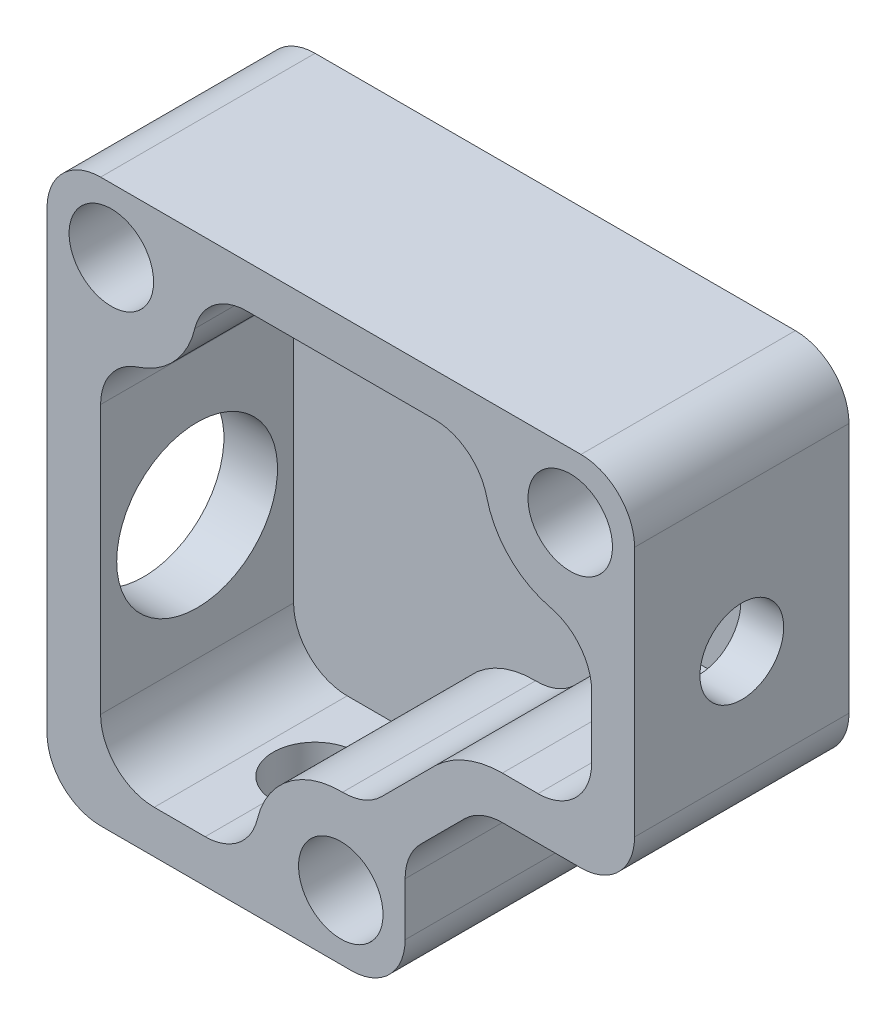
from build123d import *

# Parameters (mm, degrees)
SKETCH1_W                            = 69.596
SKETCH1_H                            = 66.548
SKETCH1_R                            = 5.0038
BOSS_EXTRUDE1_DEPTH                  = 25.4
CUT_EXTRUDE1_DEPTH                   = 44.45
FILLET1_R                            = 6.35
FILLET2_R                            = 6.35
F_25_64_0_39063_DIAMETER_HOLE1_D     = 9.922002
F_25_64_0_39063_DIAMETER_HOLE1_DEPTH = 12.7
F_25_64_0_39063_DIAMETER_HOLE1_TIP   = 2.980870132
F_25_64_0_39063_DIAMETER_HOLE2_D     = 9.922002
F_25_64_0_39063_DIAMETER_HOLE2_DEPTH = 25.4
F_25_64_0_39063_DIAMETER_HOLE2_TIP   = 2.980870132
M6X1_0_TAPPED_HOLE2_D                = 5
M6X1_0_TAPPED_HOLE2_DEPTH            = 2.54
M6X1_0_TAPPED_HOLE2_TIP              = 1.502151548
F_3_4_0_75_DIAMETER_HOLE1_D          = 19.05
F_3_4_0_75_DIAMETER_HOLE1_DEPTH      = 12.7
F_3_4_0_75_DIAMETER_HOLE1_TIP        = 5.723197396
CUT_EXTRUDE2_DEPTH                   = 22.86


with BuildPart() as part:
    # Sketch1 → Boss-Extrude1 (new body)
    with BuildSketch(Plane.XY):
        with Locations((34.798, 33.274)):
            Rectangle(SKETCH1_W, SKETCH1_H)
        with Locations((7.62, 58.928)):
            Circle(SKETCH1_R, mode=Mode.SUBTRACT)
        with Locations((61.976, 58.928)):
            Circle(SKETCH1_R, mode=Mode.SUBTRACT)
        with Locations((34.798, 7.62)):
            Circle(SKETCH1_R, mode=Mode.SUBTRACT)
    extrude(amount=BOSS_EXTRUDE1_DEPTH)

    # Sketch4 → Cut-Extrude1 (cut)
    with BuildSketch(Plane.XY.offset(25.4)):
        Polygon((69.596, 0), (42.418, 0), (42.418, 15.24), (51.308, 24.13), (69.596, 24.13), align=None)
    extrude(amount=-CUT_EXTRUDE1_DEPTH, mode=Mode.SUBTRACT)

    # Fillet1
    fillet1_edges = [part.edges().sort_by_distance(p)[0] for p in [
        (42.418, 15.24, 12.7),
        (51.308, 24.13, 12.7),
    ]]
    fillet(fillet1_edges, radius=FILLET1_R)

    # Fillet2
    fillet2_edges = [part.edges().sort_by_distance(p)[0] for p in [
        (69.596, 24.13, 12.7),
        (42.418, 0, 12.7),
        (0, 66.548, 12.7),
        (69.596, 66.548, 12.7),
        (0, 0, 12.7),
    ]]
    fillet(fillet2_edges, radius=FILLET2_R)

    # 25_64 _0.39063_ Diameter Hole1
    with Locations(Plane(origin=(0, 0, 0), x_dir=(-1, 0, 0), z_dir=(0, -1, 0))):
        with Locations((-19.05, -12.7)):
            Hole(F_25_64_0_39063_DIAMETER_HOLE1_D / 2, depth=F_25_64_0_39063_DIAMETER_HOLE1_DEPTH)
            with Locations((0, 0, -(F_25_64_0_39063_DIAMETER_HOLE1_DEPTH + F_25_64_0_39063_DIAMETER_HOLE1_TIP / 2))):  # 118° drill point
                Cone(0, F_25_64_0_39063_DIAMETER_HOLE1_D / 2, F_25_64_0_39063_DIAMETER_HOLE1_TIP, mode=Mode.SUBTRACT)

    # 25_64 _0.39063_ Diameter Hole2
    with Locations(Plane(origin=(69.596, 0, 0), x_dir=(0, 0, -1), z_dir=(1, 0, 0))):
        with Locations((-12.7, 43.18)):
            Hole(F_25_64_0_39063_DIAMETER_HOLE2_D / 2, depth=F_25_64_0_39063_DIAMETER_HOLE2_DEPTH)
            with Locations((0, 0, -(F_25_64_0_39063_DIAMETER_HOLE2_DEPTH + F_25_64_0_39063_DIAMETER_HOLE2_TIP / 2))):  # 118° drill point
                Cone(0, F_25_64_0_39063_DIAMETER_HOLE2_D / 2, F_25_64_0_39063_DIAMETER_HOLE2_TIP, mode=Mode.SUBTRACT)

    # M6x1.0 Tapped Hole2
    with Locations(Plane.ZY):
        with Locations((21.59, 50.392055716)):
            Hole(M6X1_0_TAPPED_HOLE2_D / 2, depth=M6X1_0_TAPPED_HOLE2_DEPTH)
            with Locations((0, 0, -(M6X1_0_TAPPED_HOLE2_DEPTH + M6X1_0_TAPPED_HOLE2_TIP / 2))):  # 118° drill point
                Cone(0, M6X1_0_TAPPED_HOLE2_D / 2, M6X1_0_TAPPED_HOLE2_TIP, mode=Mode.SUBTRACT)

    # 3_4 _0.75_ Diameter Hole1
    with Locations(Plane.ZY):
        with Locations((13.97, 26.162)):
            Hole(F_3_4_0_75_DIAMETER_HOLE1_D / 2, depth=F_3_4_0_75_DIAMETER_HOLE1_DEPTH)
            with Locations((0, 0, -(F_3_4_0_75_DIAMETER_HOLE1_DEPTH + F_3_4_0_75_DIAMETER_HOLE1_TIP / 2))):  # 118° drill point
                Cone(0, F_3_4_0_75_DIAMETER_HOLE1_D / 2, F_3_4_0_75_DIAMETER_HOLE1_TIP, mode=Mode.SUBTRACT)

    # Sketch23 → Cut-Extrude2 (cut)
    with BuildSketch(Plane.XY.offset(25.4)):
        with BuildLine():
            Line((45.911629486, 61.468), (23.684370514, 61.468))
            ThreePointArc((23.684370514, 61.468), (19.74626769, 60.099349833), (17.50576647, 56.583384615))
            ThreePointArc((17.50576647, 56.583384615), (15.085400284, 52.036454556), (10.746153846, 49.260903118))
            ThreePointArc((10.746153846, 49.260903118), (7.565342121, 46.954979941), (6.35, 43.218967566))
            Line((6.35, 43.218967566), (6.35, 11.43))
            ThreePointArc((6.35, 11.43), (8.209871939, 6.939871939), (12.7, 5.08))
            Line((12.7, 5.08), (18.733629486, 5.08))
            ThreePointArc((18.733629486, 5.08), (22.67173231, 6.448650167), (24.91223353, 9.964615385))
            ThreePointArc((24.91223353, 9.964615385), (28.57992687, 15.654996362), (35.008459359, 17.777819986))
            ThreePointArc((35.008459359, 17.777819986), (37.509140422, 18.234967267), (39.630124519, 19.636329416))
            Line((39.630124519, 19.636329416), (46.059561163, 26.06576606))
            ThreePointArc((46.059561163, 26.06576606), (49.697328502, 28.394919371), (53.939256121, 29.21))
            Line((53.939256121, 29.21), (58.166, 29.21))
            ThreePointArc((58.166, 29.21), (62.656128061, 31.069871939), (64.516, 35.56))
            Line((64.516, 35.56), (64.516, 42.863629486))
            ThreePointArc((64.516, 42.863629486), (63.147349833, 46.80173231), (59.631384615, 49.04223353))
            ThreePointArc((59.631384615, 49.04223353), (54.791795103, 51.743795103), (52.09023353, 56.583384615))
            ThreePointArc((52.09023353, 56.583384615), (49.84973231, 60.099349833), (45.911629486, 61.468))
        make_face()
    extrude(amount=-CUT_EXTRUDE2_DEPTH, mode=Mode.SUBTRACT)


solid = part.part
